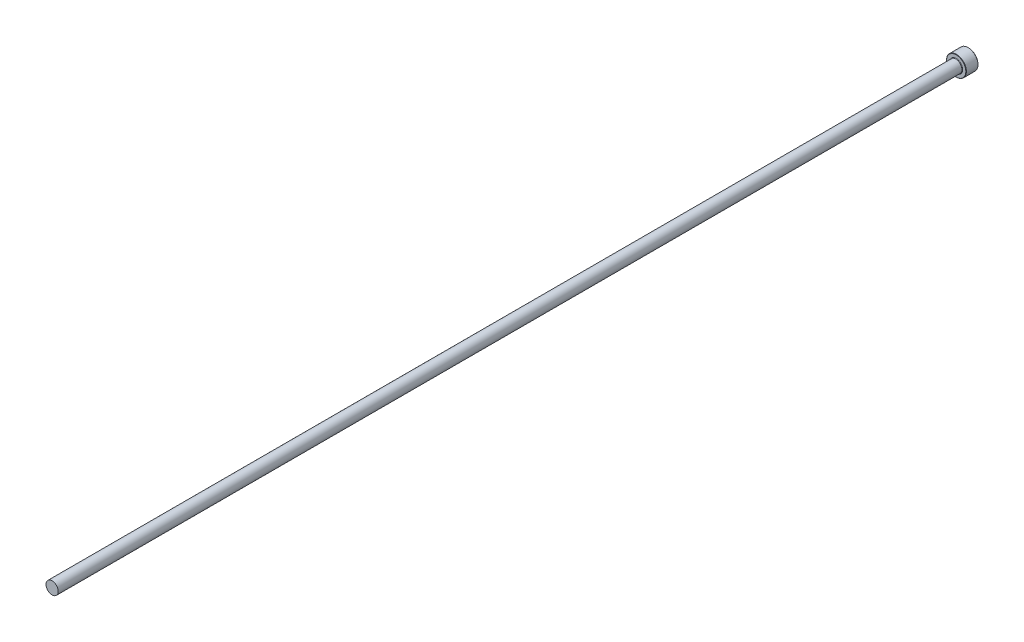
from build123d import *

# Parameters (mm, degrees)
CHAMFER1_SIZE = 0.2


with BuildPart() as part:
    # Sketch1 → Revolve1 (revolve)
    with BuildSketch(Plane(origin=(0, 0, 0), x_dir=(0, 0, -1), z_dir=(1, 0, 0)), mode=Mode.PRIVATE) as revolve1_sk:
        with BuildLine():
            Line((0, 0), (0, 6.5))
            Line((0, 6.5), (-8, 6.5))
            Line((-8, 6.5), (-8, 4.3))
            ThreePointArc((-8, 4.3), (-8.087867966, 4.087867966), (-8.3, 4))
            Line((-8.3, 4), (-600, 4))
            Line((-600, 4), (-600, 0))
            Line((-600, 0), (0, 0))
        make_face()
    revolve(revolve1_sk.sketch.rotate(Axis((0, 0, 109.05062828), (0, 0, -1)), 90), axis=Axis((0, 0, 109.05062828), (0, 0, -1)))

    # Chamfer1
    chamfer1_edges = [part.edges().sort_by_distance(p)[0] for p in [
        (-6.5, 0, 0),
        (-6.5, 0, 8),
    ]]
    chamfer(chamfer1_edges, length=CHAMFER1_SIZE)


solid = part.part
